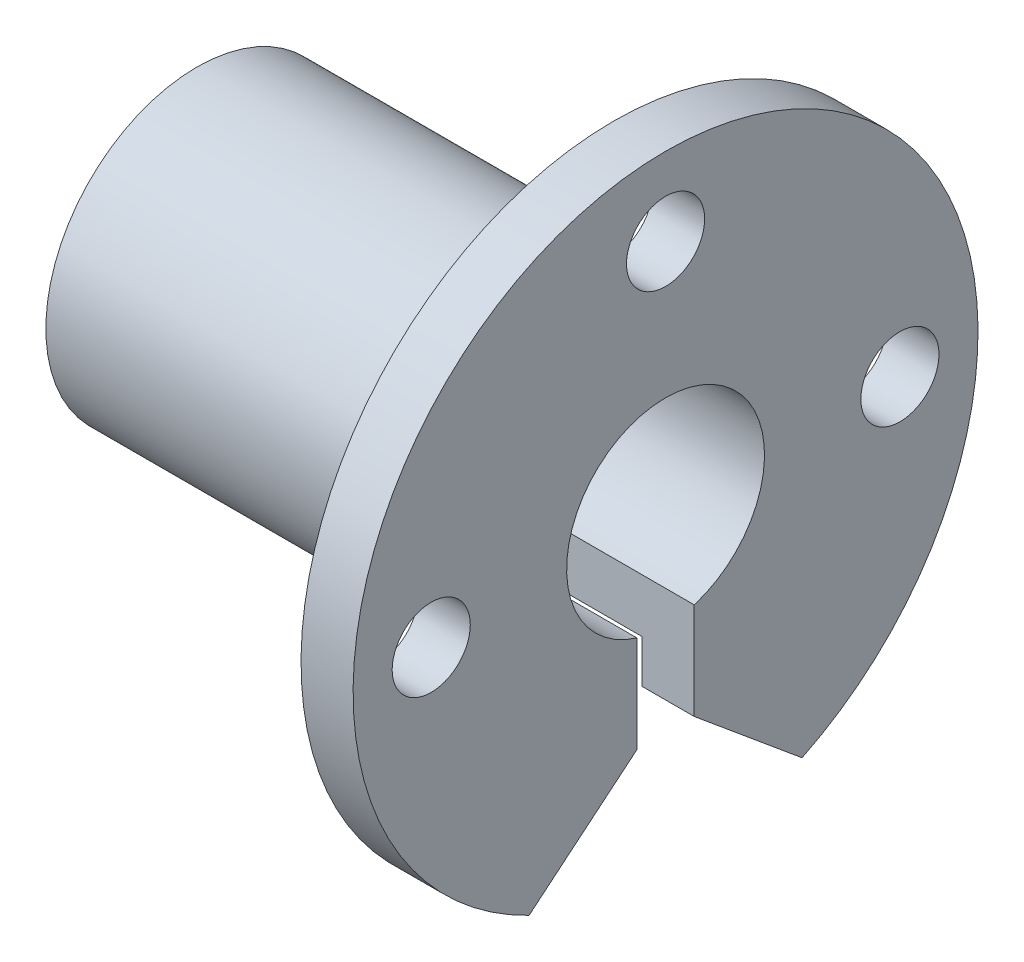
ISO-10303-21;
HEADER;
FILE_DESCRIPTION(('STEP AP214'),'2;1');
FILE_NAME('part.step','',(''),(''),'','','');
FILE_SCHEMA(('AUTOMOTIVE_DESIGN { 1 0 10303 214 1 1 1 1 }'));
ENDSEC;
DATA;
#1=APPLICATION_CONTEXT('core data for automotive mechanical design processes');
#2=APPLICATION_PROTOCOL_DEFINITION('international standard','automotive_design',2000,#1);
#3=PRODUCT_CONTEXT('',#1,'mechanical');
#4=PRODUCT('Part','Part','',(#3));
#5=PRODUCT_RELATED_PRODUCT_CATEGORY('part','',(#4));
#6=PRODUCT_DEFINITION_FORMATION('','',#4);
#7=PRODUCT_DEFINITION_CONTEXT('part definition',#1,'design');
#8=PRODUCT_DEFINITION('design','',#6,#7);
#9=PRODUCT_DEFINITION_SHAPE('','',#8);
#10=(LENGTH_UNIT() NAMED_UNIT(*) SI_UNIT(.MILLI.,.METRE.));
#11=(NAMED_UNIT(*) PLANE_ANGLE_UNIT() SI_UNIT($,.RADIAN.));
#12=(NAMED_UNIT(*) SI_UNIT($,.STERADIAN.) SOLID_ANGLE_UNIT());
#13=UNCERTAINTY_MEASURE_WITH_UNIT(LENGTH_MEASURE(1.E-05),#10,'distance_accuracy_value','');
#14=(GEOMETRIC_REPRESENTATION_CONTEXT(3) GLOBAL_UNCERTAINTY_ASSIGNED_CONTEXT((#13)) GLOBAL_UNIT_ASSIGNED_CONTEXT((#10,
#11,#12)) REPRESENTATION_CONTEXT('',''));
#15=CARTESIAN_POINT('',(0.,0.,0.));
#16=DIRECTION('',(0.,0.,1.));
#17=DIRECTION('',(1.,0.,0.));
#18=AXIS2_PLACEMENT_3D('',#15,#16,#17);
#19=CARTESIAN_POINT('',(0.,0.,0.));
#20=DIRECTION('',(1.,0.,0.));
#21=DIRECTION('',(0.,0.,-1.));
#22=AXIS2_PLACEMENT_3D('',#19,#20,#21);
#23=CYLINDRICAL_SURFACE('',#22,12.);
#24=CARTESIAN_POINT('',(0.,0.,0.));
#25=DIRECTION('',(1.,0.,0.));
#26=DIRECTION('',(0.,0.,-1.));
#27=AXIS2_PLACEMENT_3D('',#24,#25,#26);
#28=CIRCLE('',#27,12.);
#29=CARTESIAN_POINT('',(0.,-10.7947992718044,-5.24140331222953));
#30=VERTEX_POINT('',#29);
#31=CARTESIAN_POINT('',(0.,-10.7947992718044,5.24140331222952));
#32=VERTEX_POINT('',#31);
#33=EDGE_CURVE('E149',#30,#32,#28,.T.);
#34=ORIENTED_EDGE('',*,*,#33,.F.);
#35=DIRECTION('',(1.,0.,0.));
#36=VECTOR('',#35,1.);
#37=CARTESIAN_POINT('',(0.,-10.7947992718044,-5.24140331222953));
#38=LINE('',#37,#36);
#39=CARTESIAN_POINT('',(-2.,-10.7947992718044,-5.24140331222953));
#40=VERTEX_POINT('',#39);
#41=EDGE_CURVE('E166',#30,#40,#38,.F.);
#42=ORIENTED_EDGE('',*,*,#41,.T.);
#43=CARTESIAN_POINT('',(-2.,0.,0.));
#44=DIRECTION('',(1.,0.,0.));
#45=DIRECTION('',(0.,0.,-1.));
#46=AXIS2_PLACEMENT_3D('',#43,#44,#45);
#47=CIRCLE('',#46,12.);
#48=CARTESIAN_POINT('',(-2.,-10.7947992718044,5.24140331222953));
#49=VERTEX_POINT('',#48);
#50=EDGE_CURVE('E173',#40,#49,#47,.T.);
#51=ORIENTED_EDGE('',*,*,#50,.T.);
#52=DIRECTION('',(1.,0.,0.));
#53=VECTOR('',#52,1.);
#54=CARTESIAN_POINT('',(0.,-10.7947992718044,5.24140331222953));
#55=LINE('',#54,#53);
#56=EDGE_CURVE('E164',#49,#32,#55,.T.);
#57=ORIENTED_EDGE('',*,*,#56,.T.);
#58=EDGE_LOOP('',(#34,#42,#51,#57));
#59=FACE_BOUND('',#58,.T.);
#60=ADVANCED_FACE('F32',(#59),#23,.T.);
#61=CARTESIAN_POINT('',(0.,12.,0.));
#62=DIRECTION('',(1.,0.,0.));
#63=DIRECTION('',(0.,0.,-1.));
#64=AXIS2_PLACEMENT_3D('',#61,#62,#63);
#65=PLANE('',#64);
#66=CARTESIAN_POINT('',(0.,0.,9.));
#67=DIRECTION('',(1.,0.,0.));
#68=DIRECTION('',(0.,0.,-1.));
#69=AXIS2_PLACEMENT_3D('',#66,#67,#68);
#70=CIRCLE('',#69,1.5);
#71=CARTESIAN_POINT('',(0.,0.,7.5));
#72=VERTEX_POINT('',#71);
#73=EDGE_CURVE('E221',#72,#72,#70,.T.);
#74=ORIENTED_EDGE('',*,*,#73,.F.);
#75=EDGE_LOOP('',(#74));
#76=FACE_BOUND('',#75,.T.);
#77=CARTESIAN_POINT('',(0.,0.,-9.));
#78=DIRECTION('',(1.,0.,0.));
#79=DIRECTION('',(0.,0.,-1.));
#80=AXIS2_PLACEMENT_3D('',#77,#78,#79);
#81=CIRCLE('',#80,1.5);
#82=CARTESIAN_POINT('',(0.,0.,-10.5));
#83=VERTEX_POINT('',#82);
#84=EDGE_CURVE('E215',#83,#83,#81,.T.);
#85=ORIENTED_EDGE('',*,*,#84,.F.);
#86=EDGE_LOOP('',(#85));
#87=FACE_BOUND('',#86,.T.);
#88=CARTESIAN_POINT('',(0.,9.,0.));
#89=DIRECTION('',(1.,0.,0.));
#90=DIRECTION('',(0.,0.,-1.));
#91=AXIS2_PLACEMENT_3D('',#88,#89,#90);
#92=CIRCLE('',#91,1.5);
#93=CARTESIAN_POINT('',(0.,9.,-1.5));
#94=VERTEX_POINT('',#93);
#95=EDGE_CURVE('E131',#94,#94,#92,.T.);
#96=ORIENTED_EDGE('',*,*,#95,.F.);
#97=EDGE_LOOP('',(#96));
#98=FACE_BOUND('',#97,.T.);
#99=DIRECTION('',(0.,1.,0.));
#100=VECTOR('',#99,1.);
#101=CARTESIAN_POINT('',(0.,12.,-1.1));
#102=LINE('',#101,#100);
#103=CARTESIAN_POINT('',(0.,-7.35159155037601,-1.1));
#104=VERTEX_POINT('',#103);
#105=CARTESIAN_POINT('',(0.,-3.63730669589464,-1.1));
#106=VERTEX_POINT('',#105);
#107=EDGE_CURVE('E188',#104,#106,#102,.T.);
#108=ORIENTED_EDGE('',*,*,#107,.F.);
#109=DIRECTION('',(0.,0.639311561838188,0.768947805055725));
#110=VECTOR('',#109,1.);
#111=CARTESIAN_POINT('',(0.,1.09853382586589,9.06359745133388));
#112=LINE('',#111,#110);
#113=EDGE_CURVE('E162',#104,#30,#112,.F.);
#114=ORIENTED_EDGE('',*,*,#113,.T.);
#115=ORIENTED_EDGE('',*,*,#33,.T.);
#116=DIRECTION('',(0.,0.639311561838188,-0.768947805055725));
#117=VECTOR('',#116,1.);
#118=CARTESIAN_POINT('',(0.,1.09853382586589,-9.06359745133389));
#119=LINE('',#118,#117);
#120=CARTESIAN_POINT('',(0.,-7.35159155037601,1.1));
#121=VERTEX_POINT('',#120);
#122=EDGE_CURVE('E160',#32,#121,#119,.T.);
#123=ORIENTED_EDGE('',*,*,#122,.T.);
#124=DIRECTION('',(0.,-1.,0.));
#125=VECTOR('',#124,1.);
#126=CARTESIAN_POINT('',(0.,12.,1.1));
#127=LINE('',#126,#125);
#128=CARTESIAN_POINT('',(0.,-3.63730669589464,1.1));
#129=VERTEX_POINT('',#128);
#130=EDGE_CURVE('E120',#129,#121,#127,.T.);
#131=ORIENTED_EDGE('',*,*,#130,.F.);
#132=CARTESIAN_POINT('',(0.,0.,0.));
#133=DIRECTION('',(1.,0.,0.));
#134=DIRECTION('',(0.,0.,-1.));
#135=AXIS2_PLACEMENT_3D('',#132,#133,#134);
#136=CIRCLE('',#135,3.8);
#137=EDGE_CURVE('E146',#106,#129,#136,.T.);
#138=ORIENTED_EDGE('',*,*,#137,.F.);
#139=EDGE_LOOP('',(#108,#114,#115,#123,#131,#138));
#140=FACE_BOUND('',#139,.T.);
#141=ADVANCED_FACE('F185',(#76,#87,#98,#140),#65,.T.);
#142=CARTESIAN_POINT('',(0.,0.,0.));
#143=DIRECTION('',(1.,0.,0.));
#144=DIRECTION('',(0.,0.,-1.));
#145=AXIS2_PLACEMENT_3D('',#142,#143,#144);
#146=CYLINDRICAL_SURFACE('',#145,3.8);
#147=DIRECTION('',(1.,0.,0.));
#148=VECTOR('',#147,1.);
#149=CARTESIAN_POINT('',(0.,-3.63730669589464,-1.1));
#150=LINE('',#149,#148);
#151=CARTESIAN_POINT('',(-16.,-3.63730669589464,-1.1));
#152=VERTEX_POINT('',#151);
#153=EDGE_CURVE('E202',#106,#152,#150,.F.);
#154=ORIENTED_EDGE('',*,*,#153,.F.);
#155=ORIENTED_EDGE('',*,*,#137,.T.);
#156=DIRECTION('',(1.,0.,0.));
#157=VECTOR('',#156,1.);
#158=CARTESIAN_POINT('',(0.,-3.63730669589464,1.1));
#159=LINE('',#158,#157);
#160=CARTESIAN_POINT('',(-16.,-3.63730669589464,1.1));
#161=VERTEX_POINT('',#160);
#162=EDGE_CURVE('E192',#161,#129,#159,.T.);
#163=ORIENTED_EDGE('',*,*,#162,.F.);
#164=CARTESIAN_POINT('',(-16.,0.,0.));
#165=DIRECTION('',(1.,0.,0.));
#166=DIRECTION('',(0.,0.,-1.));
#167=AXIS2_PLACEMENT_3D('',#164,#165,#166);
#168=CIRCLE('',#167,3.8);
#169=EDGE_CURVE('E138',#152,#161,#168,.T.);
#170=ORIENTED_EDGE('',*,*,#169,.F.);
#171=EDGE_LOOP('',(#154,#155,#163,#170));
#172=FACE_BOUND('',#171,.T.);
#173=ADVANCED_FACE('F254',(#172),#146,.F.);
#174=CARTESIAN_POINT('',(-16.,3.8,0.));
#175=DIRECTION('',(1.,0.,0.));
#176=DIRECTION('',(0.,0.,-1.));
#177=AXIS2_PLACEMENT_3D('',#174,#175,#176);
#178=PLANE('',#177);
#179=DIRECTION('',(0.,1.,0.));
#180=VECTOR('',#179,1.);
#181=CARTESIAN_POINT('',(-16.,3.8,-1.1));
#182=LINE('',#181,#180);
#183=CARTESIAN_POINT('',(-16.,0.,-1.1));
#184=VERTEX_POINT('',#183);
#185=EDGE_CURVE('E204',#152,#184,#182,.T.);
#186=ORIENTED_EDGE('',*,*,#185,.F.);
#187=ORIENTED_EDGE('',*,*,#169,.T.);
#188=DIRECTION('',(0.,-1.,0.));
#189=VECTOR('',#188,1.);
#190=CARTESIAN_POINT('',(-16.,3.8,1.1));
#191=LINE('',#190,#189);
#192=CARTESIAN_POINT('',(-16.,0.,1.1));
#193=VERTEX_POINT('',#192);
#194=EDGE_CURVE('E194',#193,#161,#191,.T.);
#195=ORIENTED_EDGE('',*,*,#194,.F.);
#196=CARTESIAN_POINT('',(-16.,0.,0.));
#197=DIRECTION('',(1.,0.,0.));
#198=DIRECTION('',(0.,0.,-1.));
#199=AXIS2_PLACEMENT_3D('',#196,#197,#198);
#200=CIRCLE('',#199,1.1);
#201=EDGE_CURVE('E129',#184,#193,#200,.T.);
#202=ORIENTED_EDGE('',*,*,#201,.F.);
#203=EDGE_LOOP('',(#186,#187,#195,#202));
#204=FACE_BOUND('',#203,.T.);
#205=ADVANCED_FACE('F273',(#204),#178,.T.);
#206=CARTESIAN_POINT('',(0.,0.,0.));
#207=DIRECTION('',(1.,0.,0.));
#208=DIRECTION('',(0.,0.,-1.));
#209=AXIS2_PLACEMENT_3D('',#206,#207,#208);
#210=CYLINDRICAL_SURFACE('',#209,1.1);
#211=DIRECTION('',(1.,0.,0.));
#212=VECTOR('',#211,1.);
#213=CARTESIAN_POINT('',(-21.4465279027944,0.,1.1));
#214=LINE('',#213,#212);
#215=CARTESIAN_POINT('',(-18.,0.,1.1));
#216=VERTEX_POINT('',#215);
#217=EDGE_CURVE('E112',#216,#193,#214,.T.);
#218=ORIENTED_EDGE('',*,*,#217,.F.);
#219=CARTESIAN_POINT('',(-18.,0.,0.));
#220=DIRECTION('',(1.,0.,0.));
#221=DIRECTION('',(0.,0.,-1.));
#222=AXIS2_PLACEMENT_3D('',#219,#220,#221);
#223=CIRCLE('',#222,1.1);
#224=CARTESIAN_POINT('',(-18.,0.,-1.1));
#225=VERTEX_POINT('',#224);
#226=EDGE_CURVE('E127',#225,#216,#223,.T.);
#227=ORIENTED_EDGE('',*,*,#226,.F.);
#228=DIRECTION('',(-1.,0.,0.));
#229=VECTOR('',#228,1.);
#230=CARTESIAN_POINT('',(-21.4465279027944,0.,-1.1));
#231=LINE('',#230,#229);
#232=EDGE_CURVE('E130',#184,#225,#231,.T.);
#233=ORIENTED_EDGE('',*,*,#232,.F.);
#234=ORIENTED_EDGE('',*,*,#201,.T.);
#235=EDGE_LOOP('',(#218,#227,#233,#234));
#236=FACE_BOUND('',#235,.T.);
#237=ADVANCED_FACE('F125',(#236),#210,.F.);
#238=CARTESIAN_POINT('',(-18.,1.1,0.));
#239=DIRECTION('',(-1.,0.,0.));
#240=DIRECTION('',(0.,0.,1.));
#241=AXIS2_PLACEMENT_3D('',#238,#239,#240);
#242=PLANE('',#241);
#243=DIRECTION('',(0.,-1.,0.));
#244=VECTOR('',#243,1.);
#245=CARTESIAN_POINT('',(-18.,1.1,-1.1));
#246=LINE('',#245,#244);
#247=CARTESIAN_POINT('',(-18.,-5.69473440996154,-1.1));
#248=VERTEX_POINT('',#247);
#249=EDGE_CURVE('E135',#225,#248,#246,.T.);
#250=ORIENTED_EDGE('',*,*,#249,.F.);
#251=ORIENTED_EDGE('',*,*,#226,.T.);
#252=DIRECTION('',(0.,1.,0.));
#253=VECTOR('',#252,1.);
#254=CARTESIAN_POINT('',(-18.,1.1,1.1));
#255=LINE('',#254,#253);
#256=CARTESIAN_POINT('',(-18.,-5.69473440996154,1.1));
#257=VERTEX_POINT('',#256);
#258=EDGE_CURVE('E108',#257,#216,#255,.T.);
#259=ORIENTED_EDGE('',*,*,#258,.F.);
#260=CARTESIAN_POINT('',(-18.,0.,0.));
#261=DIRECTION('',(1.,0.,0.));
#262=DIRECTION('',(0.,0.,-1.));
#263=AXIS2_PLACEMENT_3D('',#260,#261,#262);
#264=CIRCLE('',#263,5.8);
#265=EDGE_CURVE('E136',#248,#257,#264,.T.);
#266=ORIENTED_EDGE('',*,*,#265,.F.);
#267=EDGE_LOOP('',(#250,#251,#259,#266));
#268=FACE_BOUND('',#267,.T.);
#269=ADVANCED_FACE('F134',(#268),#242,.T.);
#270=CARTESIAN_POINT('',(0.,0.,0.));
#271=DIRECTION('',(1.,0.,0.));
#272=DIRECTION('',(0.,0.,-1.));
#273=AXIS2_PLACEMENT_3D('',#270,#271,#272);
#274=CYLINDRICAL_SURFACE('',#273,5.8);
#275=DIRECTION('',(1.,0.,0.));
#276=VECTOR('',#275,1.);
#277=CARTESIAN_POINT('',(0.,-5.69473440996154,-1.1));
#278=LINE('',#277,#276);
#279=CARTESIAN_POINT('',(-2.,-5.69473440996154,-1.1));
#280=VERTEX_POINT('',#279);
#281=EDGE_CURVE('E181',#248,#280,#278,.T.);
#282=ORIENTED_EDGE('',*,*,#281,.F.);
#283=ORIENTED_EDGE('',*,*,#265,.T.);
#284=DIRECTION('',(1.,0.,0.));
#285=VECTOR('',#284,1.);
#286=CARTESIAN_POINT('',(0.,-5.69473440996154,1.1));
#287=LINE('',#286,#285);
#288=CARTESIAN_POINT('',(-2.,-5.69473440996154,1.1));
#289=VERTEX_POINT('',#288);
#290=EDGE_CURVE('E115',#289,#257,#287,.F.);
#291=ORIENTED_EDGE('',*,*,#290,.F.);
#292=CARTESIAN_POINT('',(-2.,0.,0.));
#293=DIRECTION('',(1.,0.,0.));
#294=DIRECTION('',(0.,0.,-1.));
#295=AXIS2_PLACEMENT_3D('',#292,#293,#294);
#296=CIRCLE('',#295,5.8);
#297=EDGE_CURVE('E140',#280,#289,#296,.T.);
#298=ORIENTED_EDGE('',*,*,#297,.F.);
#299=EDGE_LOOP('',(#282,#283,#291,#298));
#300=FACE_BOUND('',#299,.T.);
#301=ADVANCED_FACE('F207',(#300),#274,.T.);
#302=CARTESIAN_POINT('',(-2.,5.8,0.));
#303=DIRECTION('',(-1.,0.,0.));
#304=DIRECTION('',(0.,0.,1.));
#305=AXIS2_PLACEMENT_3D('',#302,#303,#304);
#306=PLANE('',#305);
#307=CARTESIAN_POINT('',(-2.,0.,9.));
#308=DIRECTION('',(-1.,0.,0.));
#309=DIRECTION('',(0.,0.,1.));
#310=AXIS2_PLACEMENT_3D('',#307,#308,#309);
#311=CIRCLE('',#310,1.5);
#312=CARTESIAN_POINT('',(-2.,0.,10.5));
#313=VERTEX_POINT('',#312);
#314=EDGE_CURVE('E224',#313,#313,#311,.T.);
#315=ORIENTED_EDGE('',*,*,#314,.F.);
#316=EDGE_LOOP('',(#315));
#317=FACE_BOUND('',#316,.T.);
#318=CARTESIAN_POINT('',(-2.,0.,-9.));
#319=DIRECTION('',(-1.,0.,0.));
#320=DIRECTION('',(0.,0.,1.));
#321=AXIS2_PLACEMENT_3D('',#318,#319,#320);
#322=CIRCLE('',#321,1.5);
#323=CARTESIAN_POINT('',(-2.,0.,-7.5));
#324=VERTEX_POINT('',#323);
#325=EDGE_CURVE('E218',#324,#324,#322,.T.);
#326=ORIENTED_EDGE('',*,*,#325,.F.);
#327=EDGE_LOOP('',(#326));
#328=FACE_BOUND('',#327,.T.);
#329=CARTESIAN_POINT('',(-2.,9.,0.));
#330=DIRECTION('',(-1.,0.,0.));
#331=DIRECTION('',(0.,0.,1.));
#332=AXIS2_PLACEMENT_3D('',#329,#330,#331);
#333=CIRCLE('',#332,1.5);
#334=CARTESIAN_POINT('',(-2.,9.,1.5));
#335=VERTEX_POINT('',#334);
#336=EDGE_CURVE('E212',#335,#335,#333,.T.);
#337=ORIENTED_EDGE('',*,*,#336,.F.);
#338=EDGE_LOOP('',(#337));
#339=FACE_BOUND('',#338,.T.);
#340=ORIENTED_EDGE('',*,*,#50,.F.);
#341=DIRECTION('',(0.,-0.639311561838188,-0.768947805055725));
#342=VECTOR('',#341,1.);
#343=CARTESIAN_POINT('',(-2.,-1.43552566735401,6.01569467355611));
#344=LINE('',#343,#342);
#345=CARTESIAN_POINT('',(-2.,-7.35159155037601,-1.1));
#346=VERTEX_POINT('',#345);
#347=EDGE_CURVE('E40',#40,#346,#344,.F.);
#348=ORIENTED_EDGE('',*,*,#347,.T.);
#349=DIRECTION('',(0.,-1.,0.));
#350=VECTOR('',#349,1.);
#351=CARTESIAN_POINT('',(-2.,5.8,-1.1));
#352=LINE('',#351,#350);
#353=EDGE_CURVE('E154',#280,#346,#352,.T.);
#354=ORIENTED_EDGE('',*,*,#353,.F.);
#355=ORIENTED_EDGE('',*,*,#297,.T.);
#356=DIRECTION('',(0.,1.,0.));
#357=VECTOR('',#356,1.);
#358=CARTESIAN_POINT('',(-2.,5.8,1.1));
#359=LINE('',#358,#357);
#360=CARTESIAN_POINT('',(-2.,-7.35159155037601,1.1));
#361=VERTEX_POINT('',#360);
#362=EDGE_CURVE('E152',#361,#289,#359,.T.);
#363=ORIENTED_EDGE('',*,*,#362,.F.);
#364=DIRECTION('',(0.,-0.639311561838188,0.768947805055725));
#365=VECTOR('',#364,1.);
#366=CARTESIAN_POINT('',(-2.,-1.435525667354,-6.01569467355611));
#367=LINE('',#366,#365);
#368=EDGE_CURVE('E47',#361,#49,#367,.T.);
#369=ORIENTED_EDGE('',*,*,#368,.T.);
#370=EDGE_LOOP('',(#340,#348,#354,#355,#363,#369));
#371=FACE_BOUND('',#370,.T.);
#372=ADVANCED_FACE('F170',(#317,#328,#339,#371),#306,.T.);
#373=CARTESIAN_POINT('',(-21.4465279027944,-12.,1.1));
#374=DIRECTION('',(0.,0.,1.));
#375=DIRECTION('',(1.,0.,0.));
#376=AXIS2_PLACEMENT_3D('',#373,#374,#375);
#377=PLANE('',#376);
#378=ORIENTED_EDGE('',*,*,#130,.T.);
#379=DIRECTION('',(-1.,0.,0.));
#380=VECTOR('',#379,1.);
#381=CARTESIAN_POINT('',(-2.,-7.35159155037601,1.1));
#382=LINE('',#381,#380);
#383=EDGE_CURVE('E11',#121,#361,#382,.T.);
#384=ORIENTED_EDGE('',*,*,#383,.T.);
#385=ORIENTED_EDGE('',*,*,#362,.T.);
#386=ORIENTED_EDGE('',*,*,#290,.T.);
#387=ORIENTED_EDGE('',*,*,#258,.T.);
#388=ORIENTED_EDGE('',*,*,#217,.T.);
#389=ORIENTED_EDGE('',*,*,#194,.T.);
#390=ORIENTED_EDGE('',*,*,#162,.T.);
#391=EDGE_LOOP('',(#378,#384,#385,#386,#387,#388,#389,#390));
#392=FACE_BOUND('',#391,.T.);
#393=ADVANCED_FACE('F111',(#392),#377,.F.);
#394=CARTESIAN_POINT('',(-21.4465279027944,-12.,-1.1));
#395=DIRECTION('',(0.,0.,-1.));
#396=DIRECTION('',(-1.,0.,0.));
#397=AXIS2_PLACEMENT_3D('',#394,#395,#396);
#398=PLANE('',#397);
#399=ORIENTED_EDGE('',*,*,#353,.T.);
#400=DIRECTION('',(1.,0.,0.));
#401=VECTOR('',#400,1.);
#402=CARTESIAN_POINT('',(0.,-7.35159155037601,-1.1));
#403=LINE('',#402,#401);
#404=EDGE_CURVE('E157',#346,#104,#403,.T.);
#405=ORIENTED_EDGE('',*,*,#404,.T.);
#406=ORIENTED_EDGE('',*,*,#107,.T.);
#407=ORIENTED_EDGE('',*,*,#153,.T.);
#408=ORIENTED_EDGE('',*,*,#185,.T.);
#409=ORIENTED_EDGE('',*,*,#232,.T.);
#410=ORIENTED_EDGE('',*,*,#249,.T.);
#411=ORIENTED_EDGE('',*,*,#281,.T.);
#412=EDGE_LOOP('',(#399,#405,#406,#407,#408,#409,#410,#411));
#413=FACE_BOUND('',#412,.T.);
#414=ADVANCED_FACE('F178',(#413),#398,.F.);
#415=CARTESIAN_POINT('',(0.,-7.35159155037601,-1.1));
#416=DIRECTION('',(0.,0.768947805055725,-0.639311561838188));
#417=DIRECTION('',(1.,0.,0.));
#418=AXIS2_PLACEMENT_3D('',#415,#416,#417);
#419=PLANE('',#418);
#420=ORIENTED_EDGE('',*,*,#347,.F.);
#421=ORIENTED_EDGE('',*,*,#41,.F.);
#422=ORIENTED_EDGE('',*,*,#113,.F.);
#423=ORIENTED_EDGE('',*,*,#404,.F.);
#424=EDGE_LOOP('',(#420,#421,#422,#423));
#425=FACE_BOUND('',#424,.T.);
#426=ADVANCED_FACE('F182',(#425),#419,.F.);
#427=CARTESIAN_POINT('',(0.,-7.35159155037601,1.1));
#428=DIRECTION('',(0.,-0.768947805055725,-0.639311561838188));
#429=DIRECTION('',(1.,0.,0.));
#430=AXIS2_PLACEMENT_3D('',#427,#428,#429);
#431=PLANE('',#430);
#432=ORIENTED_EDGE('',*,*,#122,.F.);
#433=ORIENTED_EDGE('',*,*,#56,.F.);
#434=ORIENTED_EDGE('',*,*,#368,.F.);
#435=ORIENTED_EDGE('',*,*,#383,.F.);
#436=EDGE_LOOP('',(#432,#433,#434,#435));
#437=FACE_BOUND('',#436,.T.);
#438=ADVANCED_FACE('F34',(#437),#431,.T.);
#439=CARTESIAN_POINT('',(8.,9.,0.));
#440=DIRECTION('',(-1.,0.,0.));
#441=DIRECTION('',(0.,0.,1.));
#442=AXIS2_PLACEMENT_3D('',#439,#440,#441);
#443=CYLINDRICAL_SURFACE('',#442,1.5);
#444=ORIENTED_EDGE('',*,*,#95,.T.);
#445=EDGE_LOOP('',(#444));
#446=FACE_BOUND('',#445,.T.);
#447=ORIENTED_EDGE('',*,*,#336,.T.);
#448=EDGE_LOOP('',(#447));
#449=FACE_BOUND('',#448,.T.);
#450=ADVANCED_FACE('F237',(#446,#449),#443,.F.);
#451=CARTESIAN_POINT('',(8.,0.,-9.));
#452=DIRECTION('',(-1.,0.,0.));
#453=DIRECTION('',(0.,0.,1.));
#454=AXIS2_PLACEMENT_3D('',#451,#452,#453);
#455=CYLINDRICAL_SURFACE('',#454,1.5);
#456=ORIENTED_EDGE('',*,*,#84,.T.);
#457=EDGE_LOOP('',(#456));
#458=FACE_BOUND('',#457,.T.);
#459=ORIENTED_EDGE('',*,*,#325,.T.);
#460=EDGE_LOOP('',(#459));
#461=FACE_BOUND('',#460,.T.);
#462=ADVANCED_FACE('F239',(#458,#461),#455,.F.);
#463=CARTESIAN_POINT('',(8.,0.,9.));
#464=DIRECTION('',(-1.,0.,0.));
#465=DIRECTION('',(0.,0.,1.));
#466=AXIS2_PLACEMENT_3D('',#463,#464,#465);
#467=CYLINDRICAL_SURFACE('',#466,1.5);
#468=ORIENTED_EDGE('',*,*,#73,.T.);
#469=EDGE_LOOP('',(#468));
#470=FACE_BOUND('',#469,.T.);
#471=ORIENTED_EDGE('',*,*,#314,.T.);
#472=EDGE_LOOP('',(#471));
#473=FACE_BOUND('',#472,.T.);
#474=ADVANCED_FACE('F228',(#470,#473),#467,.F.);
#475=CLOSED_SHELL('',(#60,#141,#173,#205,#237,#269,#301,#372,#393,#414,#426,#438,#450,#462,#474));
#476=MANIFOLD_SOLID_BREP('B2',#475);
#477=ADVANCED_BREP_SHAPE_REPRESENTATION('',(#18,#476),#14);
#478=SHAPE_DEFINITION_REPRESENTATION(#9,#477);
ENDSEC;
END-ISO-10303-21;
